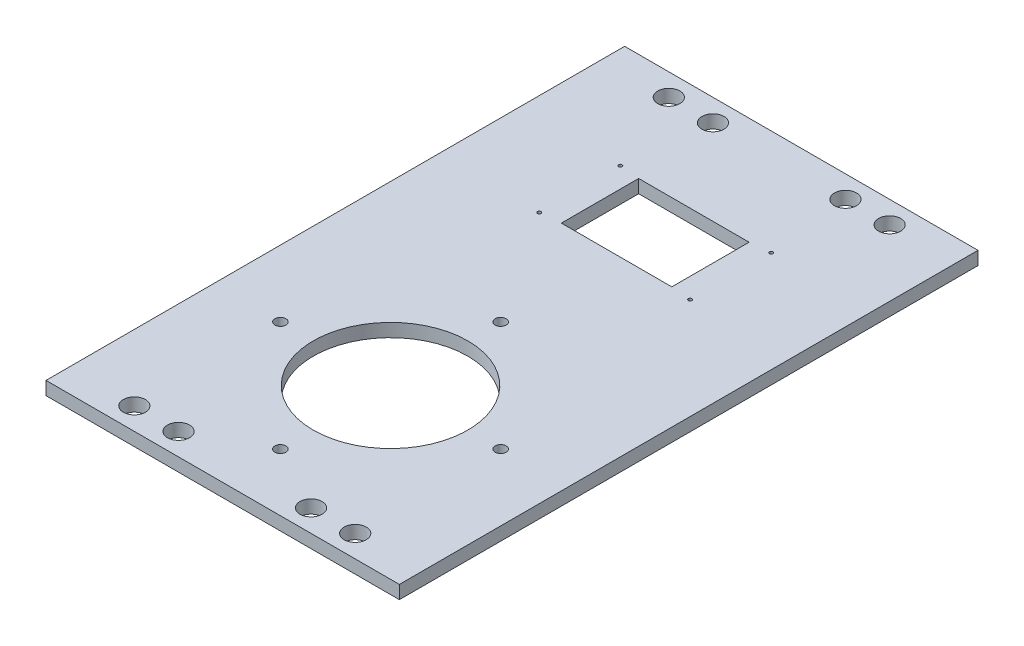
ISO-10303-21;
HEADER;
FILE_DESCRIPTION(('STEP AP214'),'2;1');
FILE_NAME('part.step','',(''),(''),'','','');
FILE_SCHEMA(('AUTOMOTIVE_DESIGN { 1 0 10303 214 1 1 1 1 }'));
ENDSEC;
DATA;
#1=APPLICATION_CONTEXT('core data for automotive mechanical design processes');
#2=APPLICATION_PROTOCOL_DEFINITION('international standard','automotive_design',2000,#1);
#3=PRODUCT_CONTEXT('',#1,'mechanical');
#4=PRODUCT('Part','Part','',(#3));
#5=PRODUCT_RELATED_PRODUCT_CATEGORY('part','',(#4));
#6=PRODUCT_DEFINITION_FORMATION('','',#4);
#7=PRODUCT_DEFINITION_CONTEXT('part definition',#1,'design');
#8=PRODUCT_DEFINITION('design','',#6,#7);
#9=PRODUCT_DEFINITION_SHAPE('','',#8);
#10=(LENGTH_UNIT() NAMED_UNIT(*) SI_UNIT(.MILLI.,.METRE.));
#11=(NAMED_UNIT(*) PLANE_ANGLE_UNIT() SI_UNIT($,.RADIAN.));
#12=(NAMED_UNIT(*) SI_UNIT($,.STERADIAN.) SOLID_ANGLE_UNIT());
#13=UNCERTAINTY_MEASURE_WITH_UNIT(LENGTH_MEASURE(1.E-05),#10,'distance_accuracy_value','');
#14=(GEOMETRIC_REPRESENTATION_CONTEXT(3) GLOBAL_UNCERTAINTY_ASSIGNED_CONTEXT((#13)) GLOBAL_UNIT_ASSIGNED_CONTEXT((#10,
#11,#12)) REPRESENTATION_CONTEXT('',''));
#15=CARTESIAN_POINT('',(0.,0.,0.));
#16=DIRECTION('',(0.,0.,1.));
#17=DIRECTION('',(1.,0.,0.));
#18=AXIS2_PLACEMENT_3D('',#15,#16,#17);
#19=CARTESIAN_POINT('',(80.,6.,131.));
#20=DIRECTION('',(-1.,0.,0.));
#21=DIRECTION('',(0.,0.,1.));
#22=AXIS2_PLACEMENT_3D('',#19,#20,#21);
#23=PLANE('',#22);
#24=DIRECTION('',(0.,0.,-1.));
#25=VECTOR('',#24,1.);
#26=CARTESIAN_POINT('',(80.,0.,131.));
#27=LINE('',#26,#25);
#28=CARTESIAN_POINT('',(80.,0.,131.));
#29=VERTEX_POINT('',#28);
#30=CARTESIAN_POINT('',(80.,0.,-131.));
#31=VERTEX_POINT('',#30);
#32=EDGE_CURVE('E214',#29,#31,#27,.T.);
#33=ORIENTED_EDGE('',*,*,#32,.T.);
#34=DIRECTION('',(0.,-1.,0.));
#35=VECTOR('',#34,1.);
#36=CARTESIAN_POINT('',(80.,6.,-131.));
#37=LINE('',#36,#35);
#38=CARTESIAN_POINT('',(80.,6.,-131.));
#39=VERTEX_POINT('',#38);
#40=EDGE_CURVE('E241',#39,#31,#37,.T.);
#41=ORIENTED_EDGE('',*,*,#40,.F.);
#42=DIRECTION('',(0.,0.,-1.));
#43=VECTOR('',#42,1.);
#44=CARTESIAN_POINT('',(80.,6.,131.));
#45=LINE('',#44,#43);
#46=CARTESIAN_POINT('',(80.,6.,131.));
#47=VERTEX_POINT('',#46);
#48=EDGE_CURVE('E215',#47,#39,#45,.T.);
#49=ORIENTED_EDGE('',*,*,#48,.F.);
#50=DIRECTION('',(0.,-1.,0.));
#51=VECTOR('',#50,1.);
#52=CARTESIAN_POINT('',(80.,6.,131.));
#53=LINE('',#52,#51);
#54=EDGE_CURVE('E225',#47,#29,#53,.T.);
#55=ORIENTED_EDGE('',*,*,#54,.T.);
#56=EDGE_LOOP('',(#33,#41,#49,#55));
#57=FACE_BOUND('',#56,.T.);
#58=ADVANCED_FACE('F32',(#57),#23,.F.);
#59=CARTESIAN_POINT('',(-80.,6.,-131.));
#60=DIRECTION('',(0.,0.,1.));
#61=DIRECTION('',(1.,0.,0.));
#62=AXIS2_PLACEMENT_3D('',#59,#60,#61);
#63=PLANE('',#62);
#64=DIRECTION('',(-1.,0.,0.));
#65=VECTOR('',#64,1.);
#66=CARTESIAN_POINT('',(-80.,0.,-131.));
#67=LINE('',#66,#65);
#68=CARTESIAN_POINT('',(-80.,0.,-131.));
#69=VERTEX_POINT('',#68);
#70=EDGE_CURVE('E228',#31,#69,#67,.T.);
#71=ORIENTED_EDGE('',*,*,#70,.T.);
#72=DIRECTION('',(0.,-1.,0.));
#73=VECTOR('',#72,1.);
#74=CARTESIAN_POINT('',(-80.,6.,-131.));
#75=LINE('',#74,#73);
#76=CARTESIAN_POINT('',(-80.,6.,-131.));
#77=VERTEX_POINT('',#76);
#78=EDGE_CURVE('E238',#77,#69,#75,.T.);
#79=ORIENTED_EDGE('',*,*,#78,.F.);
#80=DIRECTION('',(-1.,0.,0.));
#81=VECTOR('',#80,1.);
#82=CARTESIAN_POINT('',(-80.,6.,-131.));
#83=LINE('',#82,#81);
#84=EDGE_CURVE('E218',#39,#77,#83,.T.);
#85=ORIENTED_EDGE('',*,*,#84,.F.);
#86=ORIENTED_EDGE('',*,*,#40,.T.);
#87=EDGE_LOOP('',(#71,#79,#85,#86));
#88=FACE_BOUND('',#87,.T.);
#89=ADVANCED_FACE('F313',(#88),#63,.F.);
#90=CARTESIAN_POINT('',(-80.,6.,131.));
#91=DIRECTION('',(1.,0.,0.));
#92=DIRECTION('',(0.,0.,-1.));
#93=AXIS2_PLACEMENT_3D('',#90,#91,#92);
#94=PLANE('',#93);
#95=DIRECTION('',(0.,0.,1.));
#96=VECTOR('',#95,1.);
#97=CARTESIAN_POINT('',(-80.,0.,131.));
#98=LINE('',#97,#96);
#99=CARTESIAN_POINT('',(-80.,0.,131.));
#100=VERTEX_POINT('',#99);
#101=EDGE_CURVE('E230',#69,#100,#98,.T.);
#102=ORIENTED_EDGE('',*,*,#101,.T.);
#103=DIRECTION('',(0.,-1.,0.));
#104=VECTOR('',#103,1.);
#105=CARTESIAN_POINT('',(-80.,6.,131.));
#106=LINE('',#105,#104);
#107=CARTESIAN_POINT('',(-80.,6.,131.));
#108=VERTEX_POINT('',#107);
#109=EDGE_CURVE('E235',#108,#100,#106,.T.);
#110=ORIENTED_EDGE('',*,*,#109,.F.);
#111=DIRECTION('',(0.,0.,1.));
#112=VECTOR('',#111,1.);
#113=CARTESIAN_POINT('',(-80.,6.,131.));
#114=LINE('',#113,#112);
#115=EDGE_CURVE('E221',#77,#108,#114,.T.);
#116=ORIENTED_EDGE('',*,*,#115,.F.);
#117=ORIENTED_EDGE('',*,*,#78,.T.);
#118=EDGE_LOOP('',(#102,#110,#116,#117));
#119=FACE_BOUND('',#118,.T.);
#120=ADVANCED_FACE('F318',(#119),#94,.F.);
#121=CARTESIAN_POINT('',(-80.,6.,131.));
#122=DIRECTION('',(0.,0.,-1.));
#123=DIRECTION('',(-1.,0.,0.));
#124=AXIS2_PLACEMENT_3D('',#121,#122,#123);
#125=PLANE('',#124);
#126=DIRECTION('',(1.,0.,0.));
#127=VECTOR('',#126,1.);
#128=CARTESIAN_POINT('',(-80.,0.,131.));
#129=LINE('',#128,#127);
#130=EDGE_CURVE('E219',#100,#29,#129,.T.);
#131=ORIENTED_EDGE('',*,*,#130,.T.);
#132=ORIENTED_EDGE('',*,*,#54,.F.);
#133=DIRECTION('',(1.,0.,0.));
#134=VECTOR('',#133,1.);
#135=CARTESIAN_POINT('',(-80.,6.,131.));
#136=LINE('',#135,#134);
#137=EDGE_CURVE('E223',#108,#47,#136,.T.);
#138=ORIENTED_EDGE('',*,*,#137,.F.);
#139=ORIENTED_EDGE('',*,*,#109,.T.);
#140=EDGE_LOOP('',(#131,#132,#138,#139));
#141=FACE_BOUND('',#140,.T.);
#142=ADVANCED_FACE('F271',(#141),#125,.F.);
#143=CARTESIAN_POINT('',(0.,6.,0.));
#144=DIRECTION('',(0.,-1.,0.));
#145=DIRECTION('',(0.,0.,-1.));
#146=AXIS2_PLACEMENT_3D('',#143,#144,#145);
#147=PLANE('',#146);
#148=DIRECTION('',(1.,0.,0.));
#149=VECTOR('',#148,1.);
#150=CARTESIAN_POINT('',(25.,6.,-47.3525071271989));
#151=LINE('',#150,#149);
#152=CARTESIAN_POINT('',(-25.,6.,-47.3525071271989));
#153=VERTEX_POINT('',#152);
#154=CARTESIAN_POINT('',(25.,6.,-47.3525071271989));
#155=VERTEX_POINT('',#154);
#156=EDGE_CURVE('E107',#153,#155,#151,.T.);
#157=ORIENTED_EDGE('',*,*,#156,.F.);
#158=DIRECTION('',(0.,0.,1.));
#159=VECTOR('',#158,1.);
#160=CARTESIAN_POINT('',(-25.,6.,-47.3525071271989));
#161=LINE('',#160,#159);
#162=CARTESIAN_POINT('',(-25.,6.,-82.3525071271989));
#163=VERTEX_POINT('',#162);
#164=EDGE_CURVE('E46',#163,#153,#161,.T.);
#165=ORIENTED_EDGE('',*,*,#164,.F.);
#166=DIRECTION('',(-1.,0.,0.));
#167=VECTOR('',#166,1.);
#168=CARTESIAN_POINT('',(25.,6.,-82.3525071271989));
#169=LINE('',#168,#167);
#170=CARTESIAN_POINT('',(25.,6.,-82.3525071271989));
#171=VERTEX_POINT('',#170);
#172=EDGE_CURVE('E114',#171,#163,#169,.T.);
#173=ORIENTED_EDGE('',*,*,#172,.F.);
#174=DIRECTION('',(0.,0.,-1.));
#175=VECTOR('',#174,1.);
#176=CARTESIAN_POINT('',(25.,6.,-47.3525071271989));
#177=LINE('',#176,#175);
#178=EDGE_CURVE('E98',#155,#171,#177,.T.);
#179=ORIENTED_EDGE('',*,*,#178,.F.);
#180=EDGE_LOOP('',(#157,#165,#173,#179));
#181=FACE_BOUND('',#180,.T.);
#182=CARTESIAN_POINT('',(34.16,6.,-83.2125071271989));
#183=DIRECTION('',(0.,1.,0.));
#184=DIRECTION('',(0.,0.,1.));
#185=AXIS2_PLACEMENT_3D('',#182,#183,#184);
#186=CIRCLE('',#185,0.800000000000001);
#187=CARTESIAN_POINT('',(34.16,6.,-82.4125071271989));
#188=VERTEX_POINT('',#187);
#189=EDGE_CURVE('E121',#188,#188,#186,.T.);
#190=ORIENTED_EDGE('',*,*,#189,.F.);
#191=EDGE_LOOP('',(#190));
#192=FACE_BOUND('',#191,.T.);
#193=CARTESIAN_POINT('',(-34.16,6.,-83.2125071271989));
#194=DIRECTION('',(0.,1.,0.));
#195=DIRECTION('',(0.,0.,1.));
#196=AXIS2_PLACEMENT_3D('',#193,#194,#195);
#197=CIRCLE('',#196,0.800000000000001);
#198=CARTESIAN_POINT('',(-34.16,6.,-82.4125071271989));
#199=VERTEX_POINT('',#198);
#200=EDGE_CURVE('E128',#199,#199,#197,.T.);
#201=ORIENTED_EDGE('',*,*,#200,.F.);
#202=EDGE_LOOP('',(#201));
#203=FACE_BOUND('',#202,.T.);
#204=CARTESIAN_POINT('',(34.16,6.,-46.4925071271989));
#205=DIRECTION('',(0.,1.,0.));
#206=DIRECTION('',(0.,0.,1.));
#207=AXIS2_PLACEMENT_3D('',#204,#205,#206);
#208=CIRCLE('',#207,0.800000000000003);
#209=CARTESIAN_POINT('',(34.16,6.,-45.6925071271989));
#210=VERTEX_POINT('',#209);
#211=EDGE_CURVE('E124',#210,#210,#208,.T.);
#212=ORIENTED_EDGE('',*,*,#211,.F.);
#213=EDGE_LOOP('',(#212));
#214=FACE_BOUND('',#213,.T.);
#215=CARTESIAN_POINT('',(-34.16,6.,-46.4925071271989));
#216=DIRECTION('',(0.,1.,0.));
#217=DIRECTION('',(0.,0.,1.));
#218=AXIS2_PLACEMENT_3D('',#215,#216,#217);
#219=CIRCLE('',#218,0.800000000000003);
#220=CARTESIAN_POINT('',(-34.16,6.,-45.6925071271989));
#221=VERTEX_POINT('',#220);
#222=EDGE_CURVE('E131',#221,#221,#219,.T.);
#223=ORIENTED_EDGE('',*,*,#222,.F.);
#224=EDGE_LOOP('',(#223));
#225=FACE_BOUND('',#224,.T.);
#226=CARTESIAN_POINT('',(-49.8612390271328,6.,55.));
#227=DIRECTION('',(0.,1.,0.));
#228=DIRECTION('',(0.,0.,1.));
#229=AXIS2_PLACEMENT_3D('',#226,#227,#228);
#230=CIRCLE('',#229,2.5);
#231=CARTESIAN_POINT('',(-49.8612390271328,6.,57.5));
#232=VERTEX_POINT('',#231);
#233=EDGE_CURVE('E140',#232,#232,#230,.T.);
#234=ORIENTED_EDGE('',*,*,#233,.F.);
#235=EDGE_LOOP('',(#234));
#236=FACE_BOUND('',#235,.T.);
#237=CARTESIAN_POINT('',(49.8612390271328,6.,55.));
#238=DIRECTION('',(0.,1.,0.));
#239=DIRECTION('',(0.,0.,1.));
#240=AXIS2_PLACEMENT_3D('',#237,#238,#239);
#241=CIRCLE('',#240,2.5);
#242=CARTESIAN_POINT('',(49.8612390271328,6.,57.5));
#243=VERTEX_POINT('',#242);
#244=EDGE_CURVE('E146',#243,#243,#241,.T.);
#245=ORIENTED_EDGE('',*,*,#244,.F.);
#246=EDGE_LOOP('',(#245));
#247=FACE_BOUND('',#246,.T.);
#248=CARTESIAN_POINT('',(-5.26015759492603E-13,6.,5.1387609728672));
#249=DIRECTION('',(0.,1.,0.));
#250=DIRECTION('',(0.,0.,1.));
#251=AXIS2_PLACEMENT_3D('',#248,#249,#250);
#252=CIRCLE('',#251,2.5);
#253=CARTESIAN_POINT('',(-5.26015759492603E-13,6.,7.6387609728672));
#254=VERTEX_POINT('',#253);
#255=EDGE_CURVE('E152',#254,#254,#252,.T.);
#256=ORIENTED_EDGE('',*,*,#255,.F.);
#257=EDGE_LOOP('',(#256));
#258=FACE_BOUND('',#257,.T.);
#259=CARTESIAN_POINT('',(1.77836588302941E-13,6.,104.861239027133));
#260=DIRECTION('',(0.,1.,0.));
#261=DIRECTION('',(0.,0.,1.));
#262=AXIS2_PLACEMENT_3D('',#259,#260,#261);
#263=CIRCLE('',#262,2.5);
#264=CARTESIAN_POINT('',(1.77836588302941E-13,6.,107.361239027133));
#265=VERTEX_POINT('',#264);
#266=EDGE_CURVE('E139',#265,#265,#263,.T.);
#267=ORIENTED_EDGE('',*,*,#266,.F.);
#268=EDGE_LOOP('',(#267));
#269=FACE_BOUND('',#268,.T.);
#270=CARTESIAN_POINT('',(0.,6.,55.));
#271=DIRECTION('',(0.,1.,0.));
#272=DIRECTION('',(0.,0.,1.));
#273=AXIS2_PLACEMENT_3D('',#270,#271,#272);
#274=CIRCLE('',#273,35.);
#275=CARTESIAN_POINT('',(0.,6.,90.));
#276=VERTEX_POINT('',#275);
#277=EDGE_CURVE('E158',#276,#276,#274,.T.);
#278=ORIENTED_EDGE('',*,*,#277,.F.);
#279=EDGE_LOOP('',(#278));
#280=FACE_BOUND('',#279,.T.);
#281=CARTESIAN_POINT('',(-30.,6.,-121.));
#282=DIRECTION('',(0.,-1.,0.));
#283=DIRECTION('',(0.,0.,-1.));
#284=AXIS2_PLACEMENT_3D('',#281,#282,#283);
#285=CIRCLE('',#284,5.);
#286=CARTESIAN_POINT('',(-30.,6.,-126.));
#287=VERTEX_POINT('',#286);
#288=EDGE_CURVE('E181',#287,#287,#285,.F.);
#289=ORIENTED_EDGE('',*,*,#288,.F.);
#290=EDGE_LOOP('',(#289));
#291=FACE_BOUND('',#290,.T.);
#292=CARTESIAN_POINT('',(30.,6.,-121.));
#293=DIRECTION('',(0.,-1.,0.));
#294=DIRECTION('',(0.,0.,-1.));
#295=AXIS2_PLACEMENT_3D('',#292,#293,#294);
#296=CIRCLE('',#295,5.);
#297=CARTESIAN_POINT('',(30.,6.,-126.));
#298=VERTEX_POINT('',#297);
#299=EDGE_CURVE('E178',#298,#298,#296,.F.);
#300=ORIENTED_EDGE('',*,*,#299,.F.);
#301=EDGE_LOOP('',(#300));
#302=FACE_BOUND('',#301,.T.);
#303=CARTESIAN_POINT('',(50.,6.,-121.));
#304=DIRECTION('',(0.,-1.,0.));
#305=DIRECTION('',(0.,0.,-1.));
#306=AXIS2_PLACEMENT_3D('',#303,#304,#305);
#307=CIRCLE('',#306,5.);
#308=CARTESIAN_POINT('',(50.,6.,-126.));
#309=VERTEX_POINT('',#308);
#310=EDGE_CURVE('E170',#309,#309,#307,.F.);
#311=ORIENTED_EDGE('',*,*,#310,.F.);
#312=EDGE_LOOP('',(#311));
#313=FACE_BOUND('',#312,.T.);
#314=CARTESIAN_POINT('',(-50.,6.,-121.));
#315=DIRECTION('',(0.,-1.,0.));
#316=DIRECTION('',(0.,0.,-1.));
#317=AXIS2_PLACEMENT_3D('',#314,#315,#316);
#318=CIRCLE('',#317,5.);
#319=CARTESIAN_POINT('',(-50.,6.,-126.));
#320=VERTEX_POINT('',#319);
#321=EDGE_CURVE('E187',#320,#320,#318,.F.);
#322=ORIENTED_EDGE('',*,*,#321,.F.);
#323=EDGE_LOOP('',(#322));
#324=FACE_BOUND('',#323,.T.);
#325=CARTESIAN_POINT('',(-30.,6.,121.));
#326=DIRECTION('',(0.,-1.,0.));
#327=DIRECTION('',(0.,0.,-1.));
#328=AXIS2_PLACEMENT_3D('',#325,#326,#327);
#329=CIRCLE('',#328,5.);
#330=CARTESIAN_POINT('',(-30.,6.,116.));
#331=VERTEX_POINT('',#330);
#332=EDGE_CURVE('E205',#331,#331,#329,.T.);
#333=ORIENTED_EDGE('',*,*,#332,.T.);
#334=EDGE_LOOP('',(#333));
#335=FACE_BOUND('',#334,.T.);
#336=CARTESIAN_POINT('',(30.,6.,121.));
#337=DIRECTION('',(0.,-1.,0.));
#338=DIRECTION('',(0.,0.,-1.));
#339=AXIS2_PLACEMENT_3D('',#336,#337,#338);
#340=CIRCLE('',#339,5.);
#341=CARTESIAN_POINT('',(30.,6.,116.));
#342=VERTEX_POINT('',#341);
#343=EDGE_CURVE('E202',#342,#342,#340,.T.);
#344=ORIENTED_EDGE('',*,*,#343,.T.);
#345=EDGE_LOOP('',(#344));
#346=FACE_BOUND('',#345,.T.);
#347=CARTESIAN_POINT('',(50.,6.,121.));
#348=DIRECTION('',(0.,-1.,0.));
#349=DIRECTION('',(0.,0.,-1.));
#350=AXIS2_PLACEMENT_3D('',#347,#348,#349);
#351=CIRCLE('',#350,5.);
#352=CARTESIAN_POINT('',(50.,6.,116.));
#353=VERTEX_POINT('',#352);
#354=EDGE_CURVE('E194',#353,#353,#351,.T.);
#355=ORIENTED_EDGE('',*,*,#354,.T.);
#356=EDGE_LOOP('',(#355));
#357=FACE_BOUND('',#356,.T.);
#358=CARTESIAN_POINT('',(-50.,6.,121.));
#359=DIRECTION('',(0.,-1.,0.));
#360=DIRECTION('',(0.,0.,-1.));
#361=AXIS2_PLACEMENT_3D('',#358,#359,#360);
#362=CIRCLE('',#361,5.);
#363=CARTESIAN_POINT('',(-50.,6.,116.));
#364=VERTEX_POINT('',#363);
#365=EDGE_CURVE('E211',#364,#364,#362,.T.);
#366=ORIENTED_EDGE('',*,*,#365,.T.);
#367=EDGE_LOOP('',(#366));
#368=FACE_BOUND('',#367,.T.);
#369=ORIENTED_EDGE('',*,*,#48,.T.);
#370=ORIENTED_EDGE('',*,*,#84,.T.);
#371=ORIENTED_EDGE('',*,*,#115,.T.);
#372=ORIENTED_EDGE('',*,*,#137,.T.);
#373=EDGE_LOOP('',(#369,#370,#371,#372));
#374=FACE_BOUND('',#373,.T.);
#375=ADVANCED_FACE('F111',(#181,#192,#203,#214,#225,#236,#247,#258,#269,#280,#291,#302,#313,
#324,#335,#346,#357,#368,#374),#147,.F.);
#376=CARTESIAN_POINT('',(0.,0.,0.));
#377=DIRECTION('',(0.,-1.,0.));
#378=DIRECTION('',(0.,0.,-1.));
#379=AXIS2_PLACEMENT_3D('',#376,#377,#378);
#380=PLANE('',#379);
#381=DIRECTION('',(0.,0.,-1.));
#382=VECTOR('',#381,1.);
#383=CARTESIAN_POINT('',(-25.,0.,0.));
#384=LINE('',#383,#382);
#385=CARTESIAN_POINT('',(-25.,0.,-47.3525071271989));
#386=VERTEX_POINT('',#385);
#387=CARTESIAN_POINT('',(-25.,0.,-82.3525071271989));
#388=VERTEX_POINT('',#387);
#389=EDGE_CURVE('E11',#386,#388,#384,.T.);
#390=ORIENTED_EDGE('',*,*,#389,.F.);
#391=DIRECTION('',(-1.,0.,0.));
#392=VECTOR('',#391,1.);
#393=CARTESIAN_POINT('',(0.,0.,-47.3525071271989));
#394=LINE('',#393,#392);
#395=CARTESIAN_POINT('',(25.,0.,-47.3525071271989));
#396=VERTEX_POINT('',#395);
#397=EDGE_CURVE('E244',#396,#386,#394,.T.);
#398=ORIENTED_EDGE('',*,*,#397,.F.);
#399=DIRECTION('',(0.,0.,1.));
#400=VECTOR('',#399,1.);
#401=CARTESIAN_POINT('',(25.,0.,0.));
#402=LINE('',#401,#400);
#403=CARTESIAN_POINT('',(25.,0.,-82.3525071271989));
#404=VERTEX_POINT('',#403);
#405=EDGE_CURVE('E101',#404,#396,#402,.T.);
#406=ORIENTED_EDGE('',*,*,#405,.F.);
#407=DIRECTION('',(1.,0.,0.));
#408=VECTOR('',#407,1.);
#409=CARTESIAN_POINT('',(0.,0.,-82.3525071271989));
#410=LINE('',#409,#408);
#411=EDGE_CURVE('E39',#388,#404,#410,.T.);
#412=ORIENTED_EDGE('',*,*,#411,.F.);
#413=EDGE_LOOP('',(#390,#398,#406,#412));
#414=FACE_BOUND('',#413,.T.);
#415=CARTESIAN_POINT('',(34.16,0.,-83.2125071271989));
#416=DIRECTION('',(0.,-1.,0.));
#417=DIRECTION('',(0.,0.,-1.));
#418=AXIS2_PLACEMENT_3D('',#415,#416,#417);
#419=CIRCLE('',#418,0.800000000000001);
#420=CARTESIAN_POINT('',(34.16,0.,-84.0125071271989));
#421=VERTEX_POINT('',#420);
#422=EDGE_CURVE('E135',#421,#421,#419,.T.);
#423=ORIENTED_EDGE('',*,*,#422,.F.);
#424=EDGE_LOOP('',(#423));
#425=FACE_BOUND('',#424,.T.);
#426=CARTESIAN_POINT('',(-34.16,0.,-83.2125071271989));
#427=DIRECTION('',(0.,-1.,0.));
#428=DIRECTION('',(0.,0.,-1.));
#429=AXIS2_PLACEMENT_3D('',#426,#427,#428);
#430=CIRCLE('',#429,0.800000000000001);
#431=CARTESIAN_POINT('',(-34.16,0.,-84.0125071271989));
#432=VERTEX_POINT('',#431);
#433=EDGE_CURVE('E249',#432,#432,#430,.T.);
#434=ORIENTED_EDGE('',*,*,#433,.F.);
#435=EDGE_LOOP('',(#434));
#436=FACE_BOUND('',#435,.T.);
#437=CARTESIAN_POINT('',(34.16,0.,-46.4925071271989));
#438=DIRECTION('',(0.,-1.,0.));
#439=DIRECTION('',(0.,0.,-1.));
#440=AXIS2_PLACEMENT_3D('',#437,#438,#439);
#441=CIRCLE('',#440,0.800000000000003);
#442=CARTESIAN_POINT('',(34.16,0.,-47.2925071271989));
#443=VERTEX_POINT('',#442);
#444=EDGE_CURVE('E127',#443,#443,#441,.T.);
#445=ORIENTED_EDGE('',*,*,#444,.F.);
#446=EDGE_LOOP('',(#445));
#447=FACE_BOUND('',#446,.T.);
#448=CARTESIAN_POINT('',(-34.16,0.,-46.4925071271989));
#449=DIRECTION('',(0.,-1.,0.));
#450=DIRECTION('',(0.,0.,-1.));
#451=AXIS2_PLACEMENT_3D('',#448,#449,#450);
#452=CIRCLE('',#451,0.800000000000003);
#453=CARTESIAN_POINT('',(-34.16,0.,-47.2925071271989));
#454=VERTEX_POINT('',#453);
#455=EDGE_CURVE('E134',#454,#454,#452,.T.);
#456=ORIENTED_EDGE('',*,*,#455,.F.);
#457=EDGE_LOOP('',(#456));
#458=FACE_BOUND('',#457,.T.);
#459=CARTESIAN_POINT('',(-49.8612390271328,0.,55.));
#460=DIRECTION('',(0.,1.,0.));
#461=DIRECTION('',(0.,0.,1.));
#462=AXIS2_PLACEMENT_3D('',#459,#460,#461);
#463=CIRCLE('',#462,2.5);
#464=CARTESIAN_POINT('',(-49.8612390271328,0.,57.5));
#465=VERTEX_POINT('',#464);
#466=EDGE_CURVE('E136',#465,#465,#463,.T.);
#467=ORIENTED_EDGE('',*,*,#466,.T.);
#468=EDGE_LOOP('',(#467));
#469=FACE_BOUND('',#468,.T.);
#470=CARTESIAN_POINT('',(49.8612390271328,0.,55.));
#471=DIRECTION('',(0.,1.,0.));
#472=DIRECTION('',(0.,0.,1.));
#473=AXIS2_PLACEMENT_3D('',#470,#471,#472);
#474=CIRCLE('',#473,2.5);
#475=CARTESIAN_POINT('',(49.8612390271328,0.,57.5));
#476=VERTEX_POINT('',#475);
#477=EDGE_CURVE('E143',#476,#476,#474,.T.);
#478=ORIENTED_EDGE('',*,*,#477,.T.);
#479=EDGE_LOOP('',(#478));
#480=FACE_BOUND('',#479,.T.);
#481=CARTESIAN_POINT('',(-5.26015759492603E-13,0.,5.1387609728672));
#482=DIRECTION('',(0.,1.,0.));
#483=DIRECTION('',(0.,0.,1.));
#484=AXIS2_PLACEMENT_3D('',#481,#482,#483);
#485=CIRCLE('',#484,2.5);
#486=CARTESIAN_POINT('',(-5.26015759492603E-13,0.,7.6387609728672));
#487=VERTEX_POINT('',#486);
#488=EDGE_CURVE('E149',#487,#487,#485,.T.);
#489=ORIENTED_EDGE('',*,*,#488,.T.);
#490=EDGE_LOOP('',(#489));
#491=FACE_BOUND('',#490,.T.);
#492=CARTESIAN_POINT('',(1.77836588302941E-13,0.,104.861239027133));
#493=DIRECTION('',(0.,1.,0.));
#494=DIRECTION('',(0.,0.,1.));
#495=AXIS2_PLACEMENT_3D('',#492,#493,#494);
#496=CIRCLE('',#495,2.5);
#497=CARTESIAN_POINT('',(1.77836588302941E-13,0.,107.361239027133));
#498=VERTEX_POINT('',#497);
#499=EDGE_CURVE('E155',#498,#498,#496,.T.);
#500=ORIENTED_EDGE('',*,*,#499,.T.);
#501=EDGE_LOOP('',(#500));
#502=FACE_BOUND('',#501,.T.);
#503=CARTESIAN_POINT('',(0.,0.,55.));
#504=DIRECTION('',(0.,1.,0.));
#505=DIRECTION('',(0.,0.,1.));
#506=AXIS2_PLACEMENT_3D('',#503,#504,#505);
#507=CIRCLE('',#506,35.);
#508=CARTESIAN_POINT('',(0.,0.,90.));
#509=VERTEX_POINT('',#508);
#510=EDGE_CURVE('E161',#509,#509,#507,.T.);
#511=ORIENTED_EDGE('',*,*,#510,.T.);
#512=EDGE_LOOP('',(#511));
#513=FACE_BOUND('',#512,.T.);
#514=CARTESIAN_POINT('',(-30.,0.,-121.));
#515=DIRECTION('',(0.,1.,0.));
#516=DIRECTION('',(0.,0.,1.));
#517=AXIS2_PLACEMENT_3D('',#514,#515,#516);
#518=CIRCLE('',#517,5.);
#519=CARTESIAN_POINT('',(-30.,0.,-116.));
#520=VERTEX_POINT('',#519);
#521=EDGE_CURVE('E167',#520,#520,#518,.T.);
#522=ORIENTED_EDGE('',*,*,#521,.T.);
#523=EDGE_LOOP('',(#522));
#524=FACE_BOUND('',#523,.T.);
#525=CARTESIAN_POINT('',(30.,0.,-121.));
#526=DIRECTION('',(0.,1.,0.));
#527=DIRECTION('',(0.,0.,1.));
#528=AXIS2_PLACEMENT_3D('',#525,#526,#527);
#529=CIRCLE('',#528,5.);
#530=CARTESIAN_POINT('',(30.,0.,-116.));
#531=VERTEX_POINT('',#530);
#532=EDGE_CURVE('E171',#531,#531,#529,.T.);
#533=ORIENTED_EDGE('',*,*,#532,.T.);
#534=EDGE_LOOP('',(#533));
#535=FACE_BOUND('',#534,.T.);
#536=CARTESIAN_POINT('',(50.,0.,-121.));
#537=DIRECTION('',(0.,1.,0.));
#538=DIRECTION('',(0.,0.,1.));
#539=AXIS2_PLACEMENT_3D('',#536,#537,#538);
#540=CIRCLE('',#539,5.);
#541=CARTESIAN_POINT('',(50.,0.,-116.));
#542=VERTEX_POINT('',#541);
#543=EDGE_CURVE('E164',#542,#542,#540,.T.);
#544=ORIENTED_EDGE('',*,*,#543,.T.);
#545=EDGE_LOOP('',(#544));
#546=FACE_BOUND('',#545,.T.);
#547=CARTESIAN_POINT('',(-50.,0.,-121.));
#548=DIRECTION('',(0.,1.,0.));
#549=DIRECTION('',(0.,0.,1.));
#550=AXIS2_PLACEMENT_3D('',#547,#548,#549);
#551=CIRCLE('',#550,5.);
#552=CARTESIAN_POINT('',(-50.,0.,-116.));
#553=VERTEX_POINT('',#552);
#554=EDGE_CURVE('E184',#553,#553,#551,.T.);
#555=ORIENTED_EDGE('',*,*,#554,.T.);
#556=EDGE_LOOP('',(#555));
#557=FACE_BOUND('',#556,.T.);
#558=CARTESIAN_POINT('',(-30.,0.,121.));
#559=DIRECTION('',(0.,-1.,0.));
#560=DIRECTION('',(0.,0.,-1.));
#561=AXIS2_PLACEMENT_3D('',#558,#559,#560);
#562=CIRCLE('',#561,5.);
#563=CARTESIAN_POINT('',(-30.,0.,116.));
#564=VERTEX_POINT('',#563);
#565=EDGE_CURVE('E191',#564,#564,#562,.T.);
#566=ORIENTED_EDGE('',*,*,#565,.F.);
#567=EDGE_LOOP('',(#566));
#568=FACE_BOUND('',#567,.T.);
#569=CARTESIAN_POINT('',(30.,0.,121.));
#570=DIRECTION('',(0.,-1.,0.));
#571=DIRECTION('',(0.,0.,-1.));
#572=AXIS2_PLACEMENT_3D('',#569,#570,#571);
#573=CIRCLE('',#572,5.);
#574=CARTESIAN_POINT('',(30.,0.,116.));
#575=VERTEX_POINT('',#574);
#576=EDGE_CURVE('E195',#575,#575,#573,.T.);
#577=ORIENTED_EDGE('',*,*,#576,.F.);
#578=EDGE_LOOP('',(#577));
#579=FACE_BOUND('',#578,.T.);
#580=CARTESIAN_POINT('',(50.,0.,121.));
#581=DIRECTION('',(0.,-1.,0.));
#582=DIRECTION('',(0.,0.,-1.));
#583=AXIS2_PLACEMENT_3D('',#580,#581,#582);
#584=CIRCLE('',#583,5.);
#585=CARTESIAN_POINT('',(50.,0.,116.));
#586=VERTEX_POINT('',#585);
#587=EDGE_CURVE('E190',#586,#586,#584,.T.);
#588=ORIENTED_EDGE('',*,*,#587,.F.);
#589=EDGE_LOOP('',(#588));
#590=FACE_BOUND('',#589,.T.);
#591=CARTESIAN_POINT('',(-50.,0.,121.));
#592=DIRECTION('',(0.,-1.,0.));
#593=DIRECTION('',(0.,0.,-1.));
#594=AXIS2_PLACEMENT_3D('',#591,#592,#593);
#595=CIRCLE('',#594,5.);
#596=CARTESIAN_POINT('',(-50.,0.,116.));
#597=VERTEX_POINT('',#596);
#598=EDGE_CURVE('E208',#597,#597,#595,.T.);
#599=ORIENTED_EDGE('',*,*,#598,.F.);
#600=EDGE_LOOP('',(#599));
#601=FACE_BOUND('',#600,.T.);
#602=ORIENTED_EDGE('',*,*,#32,.F.);
#603=ORIENTED_EDGE('',*,*,#130,.F.);
#604=ORIENTED_EDGE('',*,*,#101,.F.);
#605=ORIENTED_EDGE('',*,*,#70,.F.);
#606=EDGE_LOOP('',(#602,#603,#604,#605));
#607=FACE_BOUND('',#606,.T.);
#608=ADVANCED_FACE('F261',(#414,#425,#436,#447,#458,#469,#480,#491,#502,#513,#524,#535,#546,
#557,#568,#579,#590,#601,#607),#380,.T.);
#609=CARTESIAN_POINT('',(-50.,10.,121.));
#610=DIRECTION('',(0.,-1.,0.));
#611=DIRECTION('',(0.,0.,-1.));
#612=AXIS2_PLACEMENT_3D('',#609,#610,#611);
#613=CYLINDRICAL_SURFACE('',#612,5.);
#614=ORIENTED_EDGE('',*,*,#598,.T.);
#615=EDGE_LOOP('',(#614));
#616=FACE_BOUND('',#615,.T.);
#617=ORIENTED_EDGE('',*,*,#365,.F.);
#618=EDGE_LOOP('',(#617));
#619=FACE_BOUND('',#618,.T.);
#620=ADVANCED_FACE('F323',(#616,#619),#613,.F.);
#621=CARTESIAN_POINT('',(50.,10.,121.));
#622=DIRECTION('',(0.,-1.,0.));
#623=DIRECTION('',(0.,0.,-1.));
#624=AXIS2_PLACEMENT_3D('',#621,#622,#623);
#625=CYLINDRICAL_SURFACE('',#624,5.);
#626=ORIENTED_EDGE('',*,*,#587,.T.);
#627=EDGE_LOOP('',(#626));
#628=FACE_BOUND('',#627,.T.);
#629=ORIENTED_EDGE('',*,*,#354,.F.);
#630=EDGE_LOOP('',(#629));
#631=FACE_BOUND('',#630,.T.);
#632=ADVANCED_FACE('F329',(#628,#631),#625,.F.);
#633=CARTESIAN_POINT('',(30.,10.,121.));
#634=DIRECTION('',(0.,-1.,0.));
#635=DIRECTION('',(0.,0.,-1.));
#636=AXIS2_PLACEMENT_3D('',#633,#634,#635);
#637=CYLINDRICAL_SURFACE('',#636,5.);
#638=ORIENTED_EDGE('',*,*,#576,.T.);
#639=EDGE_LOOP('',(#638));
#640=FACE_BOUND('',#639,.T.);
#641=ORIENTED_EDGE('',*,*,#343,.F.);
#642=EDGE_LOOP('',(#641));
#643=FACE_BOUND('',#642,.T.);
#644=ADVANCED_FACE('F367',(#640,#643),#637,.F.);
#645=CARTESIAN_POINT('',(-30.,10.,121.));
#646=DIRECTION('',(0.,-1.,0.));
#647=DIRECTION('',(0.,0.,-1.));
#648=AXIS2_PLACEMENT_3D('',#645,#646,#647);
#649=CYLINDRICAL_SURFACE('',#648,5.);
#650=ORIENTED_EDGE('',*,*,#565,.T.);
#651=EDGE_LOOP('',(#650));
#652=FACE_BOUND('',#651,.T.);
#653=ORIENTED_EDGE('',*,*,#332,.F.);
#654=EDGE_LOOP('',(#653));
#655=FACE_BOUND('',#654,.T.);
#656=ADVANCED_FACE('F375',(#652,#655),#649,.F.);
#657=CARTESIAN_POINT('',(-50.,10.,-121.));
#658=DIRECTION('',(0.,-1.,0.));
#659=DIRECTION('',(0.,0.,-1.));
#660=AXIS2_PLACEMENT_3D('',#657,#658,#659);
#661=CYLINDRICAL_SURFACE('',#660,5.);
#662=ORIENTED_EDGE('',*,*,#554,.F.);
#663=EDGE_LOOP('',(#662));
#664=FACE_BOUND('',#663,.T.);
#665=ORIENTED_EDGE('',*,*,#321,.T.);
#666=EDGE_LOOP('',(#665));
#667=FACE_BOUND('',#666,.T.);
#668=ADVANCED_FACE('F383',(#664,#667),#661,.F.);
#669=CARTESIAN_POINT('',(50.,10.,-121.));
#670=DIRECTION('',(0.,-1.,0.));
#671=DIRECTION('',(0.,0.,-1.));
#672=AXIS2_PLACEMENT_3D('',#669,#670,#671);
#673=CYLINDRICAL_SURFACE('',#672,5.);
#674=ORIENTED_EDGE('',*,*,#543,.F.);
#675=EDGE_LOOP('',(#674));
#676=FACE_BOUND('',#675,.T.);
#677=ORIENTED_EDGE('',*,*,#310,.T.);
#678=EDGE_LOOP('',(#677));
#679=FACE_BOUND('',#678,.T.);
#680=ADVANCED_FACE('F391',(#676,#679),#673,.F.);
#681=CARTESIAN_POINT('',(30.,10.,-121.));
#682=DIRECTION('',(0.,-1.,0.));
#683=DIRECTION('',(0.,0.,-1.));
#684=AXIS2_PLACEMENT_3D('',#681,#682,#683);
#685=CYLINDRICAL_SURFACE('',#684,5.);
#686=ORIENTED_EDGE('',*,*,#532,.F.);
#687=EDGE_LOOP('',(#686));
#688=FACE_BOUND('',#687,.T.);
#689=ORIENTED_EDGE('',*,*,#299,.T.);
#690=EDGE_LOOP('',(#689));
#691=FACE_BOUND('',#690,.T.);
#692=ADVANCED_FACE('F399',(#688,#691),#685,.F.);
#693=CARTESIAN_POINT('',(-30.,10.,-121.));
#694=DIRECTION('',(0.,-1.,0.));
#695=DIRECTION('',(0.,0.,-1.));
#696=AXIS2_PLACEMENT_3D('',#693,#694,#695);
#697=CYLINDRICAL_SURFACE('',#696,5.);
#698=ORIENTED_EDGE('',*,*,#521,.F.);
#699=EDGE_LOOP('',(#698));
#700=FACE_BOUND('',#699,.T.);
#701=ORIENTED_EDGE('',*,*,#288,.T.);
#702=EDGE_LOOP('',(#701));
#703=FACE_BOUND('',#702,.T.);
#704=ADVANCED_FACE('F407',(#700,#703),#697,.F.);
#705=CARTESIAN_POINT('',(0.,0.,55.));
#706=DIRECTION('',(0.,1.,0.));
#707=DIRECTION('',(0.,0.,1.));
#708=AXIS2_PLACEMENT_3D('',#705,#706,#707);
#709=CYLINDRICAL_SURFACE('',#708,35.);
#710=ORIENTED_EDGE('',*,*,#510,.F.);
#711=EDGE_LOOP('',(#710));
#712=FACE_BOUND('',#711,.T.);
#713=ORIENTED_EDGE('',*,*,#277,.T.);
#714=EDGE_LOOP('',(#713));
#715=FACE_BOUND('',#714,.T.);
#716=ADVANCED_FACE('F415',(#712,#715),#709,.F.);
#717=CARTESIAN_POINT('',(1.77836588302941E-13,0.,104.861239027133));
#718=DIRECTION('',(0.,1.,0.));
#719=DIRECTION('',(0.,0.,1.));
#720=AXIS2_PLACEMENT_3D('',#717,#718,#719);
#721=CYLINDRICAL_SURFACE('',#720,2.5);
#722=ORIENTED_EDGE('',*,*,#499,.F.);
#723=EDGE_LOOP('',(#722));
#724=FACE_BOUND('',#723,.T.);
#725=ORIENTED_EDGE('',*,*,#266,.T.);
#726=EDGE_LOOP('',(#725));
#727=FACE_BOUND('',#726,.T.);
#728=ADVANCED_FACE('F423',(#724,#727),#721,.F.);
#729=CARTESIAN_POINT('',(-5.26015759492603E-13,0.,5.1387609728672));
#730=DIRECTION('',(0.,1.,0.));
#731=DIRECTION('',(0.,0.,1.));
#732=AXIS2_PLACEMENT_3D('',#729,#730,#731);
#733=CYLINDRICAL_SURFACE('',#732,2.5);
#734=ORIENTED_EDGE('',*,*,#488,.F.);
#735=EDGE_LOOP('',(#734));
#736=FACE_BOUND('',#735,.T.);
#737=ORIENTED_EDGE('',*,*,#255,.T.);
#738=EDGE_LOOP('',(#737));
#739=FACE_BOUND('',#738,.T.);
#740=ADVANCED_FACE('F431',(#736,#739),#733,.F.);
#741=CARTESIAN_POINT('',(49.8612390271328,0.,55.));
#742=DIRECTION('',(0.,1.,0.));
#743=DIRECTION('',(0.,0.,1.));
#744=AXIS2_PLACEMENT_3D('',#741,#742,#743);
#745=CYLINDRICAL_SURFACE('',#744,2.5);
#746=ORIENTED_EDGE('',*,*,#477,.F.);
#747=EDGE_LOOP('',(#746));
#748=FACE_BOUND('',#747,.T.);
#749=ORIENTED_EDGE('',*,*,#244,.T.);
#750=EDGE_LOOP('',(#749));
#751=FACE_BOUND('',#750,.T.);
#752=ADVANCED_FACE('F439',(#748,#751),#745,.F.);
#753=CARTESIAN_POINT('',(-49.8612390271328,0.,55.));
#754=DIRECTION('',(0.,1.,0.));
#755=DIRECTION('',(0.,0.,1.));
#756=AXIS2_PLACEMENT_3D('',#753,#754,#755);
#757=CYLINDRICAL_SURFACE('',#756,2.5);
#758=ORIENTED_EDGE('',*,*,#466,.F.);
#759=EDGE_LOOP('',(#758));
#760=FACE_BOUND('',#759,.T.);
#761=ORIENTED_EDGE('',*,*,#233,.T.);
#762=EDGE_LOOP('',(#761));
#763=FACE_BOUND('',#762,.T.);
#764=ADVANCED_FACE('F447',(#760,#763),#757,.F.);
#765=CARTESIAN_POINT('',(-34.16,-4.,-46.4925071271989));
#766=DIRECTION('',(0.,1.,0.));
#767=DIRECTION('',(0.,0.,1.));
#768=AXIS2_PLACEMENT_3D('',#765,#766,#767);
#769=CYLINDRICAL_SURFACE('',#768,0.800000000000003);
#770=ORIENTED_EDGE('',*,*,#455,.T.);
#771=EDGE_LOOP('',(#770));
#772=FACE_BOUND('',#771,.T.);
#773=ORIENTED_EDGE('',*,*,#222,.T.);
#774=EDGE_LOOP('',(#773));
#775=FACE_BOUND('',#774,.T.);
#776=ADVANCED_FACE('F454',(#772,#775),#769,.F.);
#777=CARTESIAN_POINT('',(34.16,-4.,-46.4925071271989));
#778=DIRECTION('',(0.,1.,0.));
#779=DIRECTION('',(0.,0.,1.));
#780=AXIS2_PLACEMENT_3D('',#777,#778,#779);
#781=CYLINDRICAL_SURFACE('',#780,0.800000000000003);
#782=ORIENTED_EDGE('',*,*,#444,.T.);
#783=EDGE_LOOP('',(#782));
#784=FACE_BOUND('',#783,.T.);
#785=ORIENTED_EDGE('',*,*,#211,.T.);
#786=EDGE_LOOP('',(#785));
#787=FACE_BOUND('',#786,.T.);
#788=ADVANCED_FACE('F461',(#784,#787),#781,.F.);
#789=CARTESIAN_POINT('',(-34.16,-4.,-83.2125071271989));
#790=DIRECTION('',(0.,1.,0.));
#791=DIRECTION('',(0.,0.,1.));
#792=AXIS2_PLACEMENT_3D('',#789,#790,#791);
#793=CYLINDRICAL_SURFACE('',#792,0.800000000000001);
#794=ORIENTED_EDGE('',*,*,#433,.T.);
#795=EDGE_LOOP('',(#794));
#796=FACE_BOUND('',#795,.T.);
#797=ORIENTED_EDGE('',*,*,#200,.T.);
#798=EDGE_LOOP('',(#797));
#799=FACE_BOUND('',#798,.T.);
#800=ADVANCED_FACE('F469',(#796,#799),#793,.F.);
#801=CARTESIAN_POINT('',(34.16,-4.,-83.2125071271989));
#802=DIRECTION('',(0.,1.,0.));
#803=DIRECTION('',(0.,0.,1.));
#804=AXIS2_PLACEMENT_3D('',#801,#802,#803);
#805=CYLINDRICAL_SURFACE('',#804,0.800000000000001);
#806=ORIENTED_EDGE('',*,*,#422,.T.);
#807=EDGE_LOOP('',(#806));
#808=FACE_BOUND('',#807,.T.);
#809=ORIENTED_EDGE('',*,*,#189,.T.);
#810=EDGE_LOOP('',(#809));
#811=FACE_BOUND('',#810,.T.);
#812=ADVANCED_FACE('F268',(#808,#811),#805,.F.);
#813=CARTESIAN_POINT('',(-25.,-4.,-47.3525071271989));
#814=DIRECTION('',(-1.,0.,0.));
#815=DIRECTION('',(0.,0.,1.));
#816=AXIS2_PLACEMENT_3D('',#813,#814,#815);
#817=PLANE('',#816);
#818=ORIENTED_EDGE('',*,*,#389,.T.);
#819=DIRECTION('',(0.,1.,0.));
#820=VECTOR('',#819,1.);
#821=CARTESIAN_POINT('',(-25.,-4.,-82.3525071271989));
#822=LINE('',#821,#820);
#823=EDGE_CURVE('E119',#388,#163,#822,.T.);
#824=ORIENTED_EDGE('',*,*,#823,.T.);
#825=ORIENTED_EDGE('',*,*,#164,.T.);
#826=DIRECTION('',(0.,1.,0.));
#827=VECTOR('',#826,1.);
#828=CARTESIAN_POINT('',(-25.,-4.,-47.3525071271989));
#829=LINE('',#828,#827);
#830=EDGE_CURVE('E104',#386,#153,#829,.T.);
#831=ORIENTED_EDGE('',*,*,#830,.F.);
#832=EDGE_LOOP('',(#818,#824,#825,#831));
#833=FACE_BOUND('',#832,.T.);
#834=ADVANCED_FACE('F263',(#833),#817,.F.);
#835=CARTESIAN_POINT('',(25.,-4.,-82.3525071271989));
#836=DIRECTION('',(0.,0.,-1.));
#837=DIRECTION('',(-1.,0.,0.));
#838=AXIS2_PLACEMENT_3D('',#835,#836,#837);
#839=PLANE('',#838);
#840=ORIENTED_EDGE('',*,*,#411,.T.);
#841=DIRECTION('',(0.,1.,0.));
#842=VECTOR('',#841,1.);
#843=CARTESIAN_POINT('',(25.,-4.,-82.3525071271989));
#844=LINE('',#843,#842);
#845=EDGE_CURVE('E103',#404,#171,#844,.T.);
#846=ORIENTED_EDGE('',*,*,#845,.T.);
#847=ORIENTED_EDGE('',*,*,#172,.T.);
#848=ORIENTED_EDGE('',*,*,#823,.F.);
#849=EDGE_LOOP('',(#840,#846,#847,#848));
#850=FACE_BOUND('',#849,.T.);
#851=ADVANCED_FACE('F258',(#850),#839,.F.);
#852=CARTESIAN_POINT('',(25.,-4.,-47.3525071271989));
#853=DIRECTION('',(1.,0.,0.));
#854=DIRECTION('',(0.,0.,-1.));
#855=AXIS2_PLACEMENT_3D('',#852,#853,#854);
#856=PLANE('',#855);
#857=ORIENTED_EDGE('',*,*,#405,.T.);
#858=DIRECTION('',(0.,1.,0.));
#859=VECTOR('',#858,1.);
#860=CARTESIAN_POINT('',(25.,-4.,-47.3525071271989));
#861=LINE('',#860,#859);
#862=EDGE_CURVE('E54',#396,#155,#861,.T.);
#863=ORIENTED_EDGE('',*,*,#862,.T.);
#864=ORIENTED_EDGE('',*,*,#178,.T.);
#865=ORIENTED_EDGE('',*,*,#845,.F.);
#866=EDGE_LOOP('',(#857,#863,#864,#865));
#867=FACE_BOUND('',#866,.T.);
#868=ADVANCED_FACE('F95',(#867),#856,.F.);
#869=CARTESIAN_POINT('',(25.,-4.,-47.3525071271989));
#870=DIRECTION('',(0.,0.,1.));
#871=DIRECTION('',(1.,0.,0.));
#872=AXIS2_PLACEMENT_3D('',#869,#870,#871);
#873=PLANE('',#872);
#874=ORIENTED_EDGE('',*,*,#397,.T.);
#875=ORIENTED_EDGE('',*,*,#830,.T.);
#876=ORIENTED_EDGE('',*,*,#156,.T.);
#877=ORIENTED_EDGE('',*,*,#862,.F.);
#878=EDGE_LOOP('',(#874,#875,#876,#877));
#879=FACE_BOUND('',#878,.T.);
#880=ADVANCED_FACE('F108',(#879),#873,.F.);
#881=CLOSED_SHELL('',(#58,#89,#120,#142,#375,#608,#620,#632,#644,#656,#668,#680,#692,#704,#716,
#728,#740,#752,#764,#776,#788,#800,#812,#834,#851,#868,#880));
#882=MANIFOLD_SOLID_BREP('B2',#881);
#883=ADVANCED_BREP_SHAPE_REPRESENTATION('',(#18,#882),#14);
#884=SHAPE_DEFINITION_REPRESENTATION(#9,#883);
ENDSEC;
END-ISO-10303-21;
